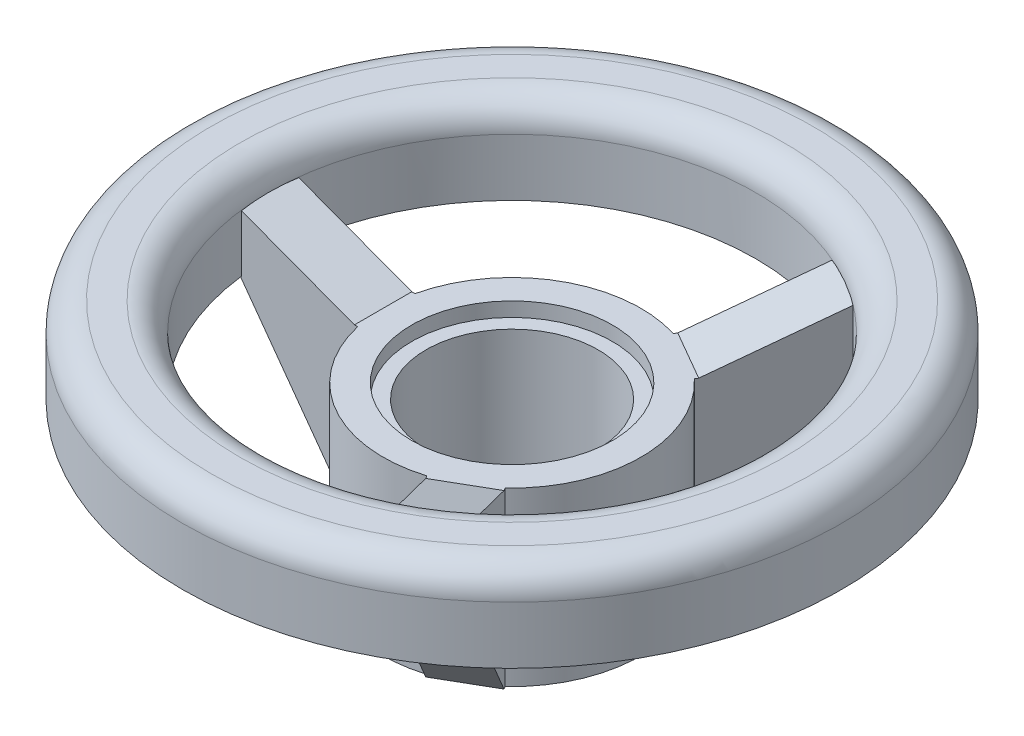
ISO-10303-21;
HEADER;
FILE_DESCRIPTION(('STEP AP214'),'2;1');
FILE_NAME('part.step','',(''),(''),'','','');
FILE_SCHEMA(('AUTOMOTIVE_DESIGN { 1 0 10303 214 1 1 1 1 }'));
ENDSEC;
DATA;
#1=APPLICATION_CONTEXT('core data for automotive mechanical design processes');
#2=APPLICATION_PROTOCOL_DEFINITION('international standard','automotive_design',2000,#1);
#3=PRODUCT_CONTEXT('',#1,'mechanical');
#4=PRODUCT('Part','Part','',(#3));
#5=PRODUCT_RELATED_PRODUCT_CATEGORY('part','',(#4));
#6=PRODUCT_DEFINITION_FORMATION('','',#4);
#7=PRODUCT_DEFINITION_CONTEXT('part definition',#1,'design');
#8=PRODUCT_DEFINITION('design','',#6,#7);
#9=PRODUCT_DEFINITION_SHAPE('','',#8);
#10=(LENGTH_UNIT() NAMED_UNIT(*) SI_UNIT(.MILLI.,.METRE.));
#11=(NAMED_UNIT(*) PLANE_ANGLE_UNIT() SI_UNIT($,.RADIAN.));
#12=(NAMED_UNIT(*) SI_UNIT($,.STERADIAN.) SOLID_ANGLE_UNIT());
#13=UNCERTAINTY_MEASURE_WITH_UNIT(LENGTH_MEASURE(1.E-05),#10,'distance_accuracy_value','');
#14=(GEOMETRIC_REPRESENTATION_CONTEXT(3) GLOBAL_UNCERTAINTY_ASSIGNED_CONTEXT((#13)) GLOBAL_UNIT_ASSIGNED_CONTEXT((#10,
#11,#12)) REPRESENTATION_CONTEXT('',''));
#15=CARTESIAN_POINT('',(0.,0.,0.));
#16=DIRECTION('',(0.,0.,1.));
#17=DIRECTION('',(1.,0.,0.));
#18=AXIS2_PLACEMENT_3D('',#15,#16,#17);
#19=CARTESIAN_POINT('',(0.,21.7519463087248,0.));
#20=DIRECTION('',(0.,1.,0.));
#21=DIRECTION('',(0.,0.,1.));
#22=AXIS2_PLACEMENT_3D('',#19,#20,#21);
#23=CYLINDRICAL_SURFACE('',#22,4.25);
#24=CARTESIAN_POINT('',(0.,-0.843750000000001,0.));
#25=DIRECTION('',(0.175561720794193,-0.936329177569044,0.304081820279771));
#26=DIRECTION('',(0.468164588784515,0.351123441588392,0.810884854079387));
#27=AXIS2_PLACEMENT_3D('',#24,#25,#26);
#28=ELLIPSE('',#27,4.53900198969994,4.25);
#29=CARTESIAN_POINT('',(2.54325557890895,0.738932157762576,3.40504787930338));
#30=VERTEX_POINT('',#29);
#31=CARTESIAN_POINT('',(2.12499999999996,0.75,3.68060796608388));
#32=VERTEX_POINT('',#31);
#33=EDGE_CURVE('E209',#30,#32,#28,.T.);
#34=ORIENTED_EDGE('',*,*,#33,.T.);
#35=CARTESIAN_POINT('',(0.,0.750000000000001,0.));
#36=DIRECTION('',(0.,1.,0.));
#37=DIRECTION('',(0.,0.,1.));
#38=AXIS2_PLACEMENT_3D('',#35,#36,#37);
#39=CIRCLE('',#38,4.25);
#40=CARTESIAN_POINT('',(2.12500000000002,0.75,-3.68060796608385));
#41=VERTEX_POINT('',#40);
#42=EDGE_CURVE('E11',#32,#41,#39,.T.);
#43=ORIENTED_EDGE('',*,*,#42,.T.);
#44=CARTESIAN_POINT('',(0.,-0.843750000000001,0.));
#45=DIRECTION('',(0.175561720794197,-0.936329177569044,-0.304081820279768));
#46=DIRECTION('',(0.468164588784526,0.351123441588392,-0.810884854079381));
#47=AXIS2_PLACEMENT_3D('',#44,#45,#46);
#48=ELLIPSE('',#47,4.53900198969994,4.25);
#49=CARTESIAN_POINT('',(2.543255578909,0.738932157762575,-3.40504787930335));
#50=VERTEX_POINT('',#49);
#51=EDGE_CURVE('E252',#41,#50,#48,.T.);
#52=ORIENTED_EDGE('',*,*,#51,.T.);
#53=DIRECTION('',(0.,1.,0.));
#54=VECTOR('',#53,1.);
#55=CARTESIAN_POINT('',(2.543255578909,21.7519463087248,-3.40504787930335));
#56=LINE('',#55,#54);
#57=CARTESIAN_POINT('',(2.543255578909,-0.25,-3.40504787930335));
#58=VERTEX_POINT('',#57);
#59=EDGE_CURVE('E410',#50,#58,#56,.F.);
#60=ORIENTED_EDGE('',*,*,#59,.T.);
#61=CARTESIAN_POINT('',(0.,-0.25,0.));
#62=DIRECTION('',(0.,1.,0.));
#63=DIRECTION('',(0.,0.,1.));
#64=AXIS2_PLACEMENT_3D('',#61,#62,#63);
#65=CIRCLE('',#64,4.25);
#66=CARTESIAN_POINT('',(2.54325557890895,-0.25,3.40504787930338));
#67=VERTEX_POINT('',#66);
#68=EDGE_CURVE('E396',#67,#58,#65,.T.);
#69=ORIENTED_EDGE('',*,*,#68,.F.);
#70=DIRECTION('',(0.,1.,0.));
#71=VECTOR('',#70,1.);
#72=CARTESIAN_POINT('',(2.54325557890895,21.7519463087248,3.40504787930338));
#73=LINE('',#72,#71);
#74=EDGE_CURVE('E237',#30,#67,#73,.F.);
#75=ORIENTED_EDGE('',*,*,#74,.F.);
#76=EDGE_LOOP('',(#34,#43,#52,#60,#69,#75));
#77=FACE_BOUND('',#76,.T.);
#78=ADVANCED_FACE('F32',(#77),#23,.F.);
#79=CARTESIAN_POINT('',(1.67723017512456,0.738932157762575,-3.90504787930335));
#80=VERTEX_POINT('',#79);
#81=EDGE_CURVE('E272',#80,#41,#48,.T.);
#82=ORIENTED_EDGE('',*,*,#81,.T.);
#83=CARTESIAN_POINT('',(0.,0.750000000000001,0.));
#84=DIRECTION('',(0.,1.,0.));
#85=DIRECTION('',(0.,0.,1.));
#86=AXIS2_PLACEMENT_3D('',#83,#84,#85);
#87=CIRCLE('',#86,4.25);
#88=CARTESIAN_POINT('',(-4.25,0.75,0.));
#89=VERTEX_POINT('',#88);
#90=EDGE_CURVE('E40',#41,#89,#87,.T.);
#91=ORIENTED_EDGE('',*,*,#90,.T.);
#92=CARTESIAN_POINT('',(0.,-0.843750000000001,0.));
#93=DIRECTION('',(-0.351123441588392,-0.936329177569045,0.));
#94=DIRECTION('',(-0.936329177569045,0.351123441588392,0.));
#95=AXIS2_PLACEMENT_3D('',#92,#93,#94);
#96=ELLIPSE('',#95,4.53900198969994,4.25);
#97=CARTESIAN_POINT('',(-4.22048575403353,0.738932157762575,-0.5));
#98=VERTEX_POINT('',#97);
#99=EDGE_CURVE('E255',#89,#98,#96,.T.);
#100=ORIENTED_EDGE('',*,*,#99,.T.);
#101=DIRECTION('',(0.,1.,0.));
#102=VECTOR('',#101,1.);
#103=CARTESIAN_POINT('',(-4.22048575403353,21.7519463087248,-0.5));
#104=LINE('',#103,#102);
#105=CARTESIAN_POINT('',(-4.22048575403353,-0.25,-0.5));
#106=VERTEX_POINT('',#105);
#107=EDGE_CURVE('E330',#98,#106,#104,.F.);
#108=ORIENTED_EDGE('',*,*,#107,.T.);
#109=CARTESIAN_POINT('',(1.67723017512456,-0.25,-3.90504787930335));
#110=VERTEX_POINT('',#109);
#111=EDGE_CURVE('E269',#110,#106,#65,.T.);
#112=ORIENTED_EDGE('',*,*,#111,.F.);
#113=DIRECTION('',(0.,1.,0.));
#114=VECTOR('',#113,1.);
#115=CARTESIAN_POINT('',(1.67723017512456,21.7519463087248,-3.90504787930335));
#116=LINE('',#115,#114);
#117=EDGE_CURVE('E415',#80,#110,#116,.F.);
#118=ORIENTED_EDGE('',*,*,#117,.F.);
#119=EDGE_LOOP('',(#82,#91,#100,#108,#112,#118));
#120=FACE_BOUND('',#119,.T.);
#121=ADVANCED_FACE('F363',(#120),#23,.F.);
#122=CARTESIAN_POINT('',(0.,21.7519463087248,0.));
#123=DIRECTION('',(0.,1.,0.));
#124=DIRECTION('',(0.,0.,1.));
#125=AXIS2_PLACEMENT_3D('',#122,#123,#124);
#126=CYLINDRICAL_SURFACE('',#125,2.25);
#127=CARTESIAN_POINT('',(0.,-3.,0.));
#128=DIRECTION('',(0.,1.,0.));
#129=DIRECTION('',(0.,0.,1.));
#130=AXIS2_PLACEMENT_3D('',#127,#128,#129);
#131=CIRCLE('',#130,2.25);
#132=CARTESIAN_POINT('',(-2.19374109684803,-3.,0.5));
#133=VERTEX_POINT('',#132);
#134=CARTESIAN_POINT('',(0.663857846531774,-3.,2.14983551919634));
#135=VERTEX_POINT('',#134);
#136=EDGE_CURVE('E284',#133,#135,#131,.T.);
#137=ORIENTED_EDGE('',*,*,#136,.T.);
#138=DIRECTION('',(0.,1.,0.));
#139=VECTOR('',#138,1.);
#140=CARTESIAN_POINT('',(0.663857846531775,21.7519463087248,2.14983551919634));
#141=LINE('',#140,#139);
#142=CARTESIAN_POINT('',(0.663857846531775,0.,2.14983551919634));
#143=VERTEX_POINT('',#142);
#144=EDGE_CURVE('E232',#135,#143,#141,.T.);
#145=ORIENTED_EDGE('',*,*,#144,.T.);
#146=CARTESIAN_POINT('',(0.,0.,0.));
#147=DIRECTION('',(0.,1.,0.));
#148=DIRECTION('',(0.,0.,1.));
#149=AXIS2_PLACEMENT_3D('',#146,#147,#148);
#150=CIRCLE('',#149,2.25);
#151=CARTESIAN_POINT('',(-2.19374109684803,0.,0.5));
#152=VERTEX_POINT('',#151);
#153=EDGE_CURVE('E279',#152,#143,#150,.T.);
#154=ORIENTED_EDGE('',*,*,#153,.F.);
#155=DIRECTION('',(0.,1.,0.));
#156=VECTOR('',#155,1.);
#157=CARTESIAN_POINT('',(-2.19374109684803,21.7519463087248,0.5));
#158=LINE('',#157,#156);
#159=EDGE_CURVE('E300',#152,#133,#158,.F.);
#160=ORIENTED_EDGE('',*,*,#159,.T.);
#161=EDGE_LOOP('',(#137,#145,#154,#160));
#162=FACE_BOUND('',#161,.T.);
#163=ADVANCED_FACE('F464',(#162),#126,.T.);
#164=DIRECTION('',(0.,1.,0.));
#165=VECTOR('',#164,1.);
#166=CARTESIAN_POINT('',(1.52988325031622,21.7519463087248,1.64983551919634));
#167=LINE('',#166,#165);
#168=CARTESIAN_POINT('',(1.52988325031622,-3.,1.64983551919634));
#169=VERTEX_POINT('',#168);
#170=CARTESIAN_POINT('',(1.52988325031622,0.,1.64983551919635));
#171=VERTEX_POINT('',#170);
#172=EDGE_CURVE('E191',#169,#171,#167,.T.);
#173=ORIENTED_EDGE('',*,*,#172,.F.);
#174=CARTESIAN_POINT('',(1.52988325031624,-3.,-1.64983551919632));
#175=VERTEX_POINT('',#174);
#176=EDGE_CURVE('E288',#169,#175,#131,.T.);
#177=ORIENTED_EDGE('',*,*,#176,.T.);
#178=DIRECTION('',(0.,1.,0.));
#179=VECTOR('',#178,1.);
#180=CARTESIAN_POINT('',(1.52988325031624,21.7519463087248,-1.64983551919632));
#181=LINE('',#180,#179);
#182=CARTESIAN_POINT('',(1.52988325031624,0.,-1.64983551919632));
#183=VERTEX_POINT('',#182);
#184=EDGE_CURVE('E382',#175,#183,#181,.T.);
#185=ORIENTED_EDGE('',*,*,#184,.T.);
#186=EDGE_CURVE('E283',#171,#183,#150,.T.);
#187=ORIENTED_EDGE('',*,*,#186,.F.);
#188=EDGE_LOOP('',(#173,#177,#185,#187));
#189=FACE_BOUND('',#188,.T.);
#190=ADVANCED_FACE('F461',(#189),#126,.T.);
#191=CARTESIAN_POINT('',(0.,21.7519463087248,0.));
#192=DIRECTION('',(0.,1.,0.));
#193=DIRECTION('',(0.,0.,1.));
#194=AXIS2_PLACEMENT_3D('',#191,#192,#193);
#195=CYLINDRICAL_SURFACE('',#194,5.75);
#196=CARTESIAN_POINT('',(0.,0.750000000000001,0.));
#197=DIRECTION('',(0.,1.,0.));
#198=DIRECTION('',(0.,0.,1.));
#199=AXIS2_PLACEMENT_3D('',#196,#197,#198);
#200=CIRCLE('',#199,5.75);
#201=CARTESIAN_POINT('',(0.,0.750000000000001,5.75));
#202=VERTEX_POINT('',#201);
#203=EDGE_CURVE('E371',#202,#202,#200,.F.);
#204=ORIENTED_EDGE('',*,*,#203,.T.);
#205=EDGE_LOOP('',(#204));
#206=FACE_BOUND('',#205,.T.);
#207=CARTESIAN_POINT('',(0.,-0.25,0.));
#208=DIRECTION('',(0.,1.,0.));
#209=DIRECTION('',(0.,0.,1.));
#210=AXIS2_PLACEMENT_3D('',#207,#208,#209);
#211=CIRCLE('',#210,5.75);
#212=CARTESIAN_POINT('',(0.,-0.25,5.75));
#213=VERTEX_POINT('',#212);
#214=EDGE_CURVE('E391',#213,#213,#211,.T.);
#215=ORIENTED_EDGE('',*,*,#214,.T.);
#216=EDGE_LOOP('',(#215));
#217=FACE_BOUND('',#216,.T.);
#218=ADVANCED_FACE('F463',(#206,#217),#195,.T.);
#219=CARTESIAN_POINT('',(-5.75,-0.25,0.));
#220=DIRECTION('',(0.,-1.,0.));
#221=DIRECTION('',(0.,0.,-1.));
#222=AXIS2_PLACEMENT_3D('',#219,#220,#221);
#223=PLANE('',#222);
#224=DIRECTION('',(0.499999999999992,0.,0.866025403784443));
#225=VECTOR('',#224,1.);
#226=CARTESIAN_POINT('',(-1.00448729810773,-0.25,-2.73982303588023));
#227=LINE('',#226,#225);
#228=CARTESIAN_POINT('',(2.55801270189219,-0.25,3.43060796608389));
#229=VERTEX_POINT('',#228);
#230=EDGE_CURVE('E235',#67,#229,#227,.T.);
#231=ORIENTED_EDGE('',*,*,#230,.F.);
#232=ORIENTED_EDGE('',*,*,#68,.T.);
#233=DIRECTION('',(0.500000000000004,0.,-0.866025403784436));
#234=VECTOR('',#233,1.);
#235=CARTESIAN_POINT('',(-1.0044872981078,-0.25,2.73982303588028));
#236=LINE('',#235,#234);
#237=CARTESIAN_POINT('',(2.55801270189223,-0.25,-3.43060796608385));
#238=VERTEX_POINT('',#237);
#239=EDGE_CURVE('E401',#58,#238,#236,.T.);
#240=ORIENTED_EDGE('',*,*,#239,.T.);
#241=DIRECTION('',(0.866025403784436,0.,0.500000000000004));
#242=VECTOR('',#241,1.);
#243=CARTESIAN_POINT('',(1.6919872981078,-0.25,-3.93060796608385));
#244=LINE('',#243,#242);
#245=CARTESIAN_POINT('',(1.6919872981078,-0.25,-3.93060796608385));
#246=VERTEX_POINT('',#245);
#247=EDGE_CURVE('E420',#246,#238,#244,.T.);
#248=ORIENTED_EDGE('',*,*,#247,.F.);
#249=DIRECTION('',(0.500000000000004,0.,-0.866025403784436));
#250=VECTOR('',#249,1.);
#251=CARTESIAN_POINT('',(-1.87051270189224,-0.25,2.23982303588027));
#252=LINE('',#251,#250);
#253=EDGE_CURVE('E277',#110,#246,#252,.T.);
#254=ORIENTED_EDGE('',*,*,#253,.F.);
#255=ORIENTED_EDGE('',*,*,#111,.T.);
#256=DIRECTION('',(-1.,0.,0.));
#257=VECTOR('',#256,1.);
#258=CARTESIAN_POINT('',(-5.75,-0.25,-0.5));
#259=LINE('',#258,#257);
#260=CARTESIAN_POINT('',(-4.25,-0.25,-0.5));
#261=VERTEX_POINT('',#260);
#262=EDGE_CURVE('E333',#106,#261,#259,.T.);
#263=ORIENTED_EDGE('',*,*,#262,.T.);
#264=DIRECTION('',(0.,0.,-1.));
#265=VECTOR('',#264,1.);
#266=CARTESIAN_POINT('',(-4.25,-0.25,0.5));
#267=LINE('',#266,#265);
#268=CARTESIAN_POINT('',(-4.25,-0.25,0.5));
#269=VERTEX_POINT('',#268);
#270=EDGE_CURVE('E326',#269,#261,#267,.T.);
#271=ORIENTED_EDGE('',*,*,#270,.F.);
#272=DIRECTION('',(-1.,0.,0.));
#273=VECTOR('',#272,1.);
#274=CARTESIAN_POINT('',(-5.75,-0.25,0.5));
#275=LINE('',#274,#273);
#276=CARTESIAN_POINT('',(-4.22048575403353,-0.25,0.5));
#277=VERTEX_POINT('',#276);
#278=EDGE_CURVE('E259',#277,#269,#275,.T.);
#279=ORIENTED_EDGE('',*,*,#278,.F.);
#280=CARTESIAN_POINT('',(1.67723017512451,-0.25,3.90504787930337));
#281=VERTEX_POINT('',#280);
#282=EDGE_CURVE('E264',#277,#281,#65,.T.);
#283=ORIENTED_EDGE('',*,*,#282,.T.);
#284=DIRECTION('',(0.499999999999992,0.,0.866025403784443));
#285=VECTOR('',#284,1.);
#286=CARTESIAN_POINT('',(-1.87051270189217,-0.25,-2.23982303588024));
#287=LINE('',#286,#285);
#288=CARTESIAN_POINT('',(1.69198729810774,-0.250000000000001,3.93060796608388));
#289=VERTEX_POINT('',#288);
#290=EDGE_CURVE('E204',#281,#289,#287,.T.);
#291=ORIENTED_EDGE('',*,*,#290,.T.);
#292=DIRECTION('',(-0.866025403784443,0.,0.499999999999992));
#293=VECTOR('',#292,1.);
#294=CARTESIAN_POINT('',(2.55801270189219,-0.25,3.43060796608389));
#295=LINE('',#294,#293);
#296=EDGE_CURVE('E205',#229,#289,#295,.T.);
#297=ORIENTED_EDGE('',*,*,#296,.F.);
#298=EDGE_LOOP('',(#231,#232,#240,#248,#254,#255,#263,#271,#279,#283,#291,#297));
#299=FACE_BOUND('',#298,.T.);
#300=ORIENTED_EDGE('',*,*,#214,.F.);
#301=EDGE_LOOP('',(#300));
#302=FACE_BOUND('',#301,.T.);
#303=ADVANCED_FACE('F352',(#299,#302),#223,.T.);
#304=CARTESIAN_POINT('',(-4.22048575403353,0.738932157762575,0.5));
#305=VERTEX_POINT('',#304);
#306=EDGE_CURVE('E258',#305,#89,#96,.T.);
#307=ORIENTED_EDGE('',*,*,#306,.T.);
#308=CARTESIAN_POINT('',(0.,0.750000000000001,0.));
#309=DIRECTION('',(0.,1.,0.));
#310=DIRECTION('',(0.,0.,1.));
#311=AXIS2_PLACEMENT_3D('',#308,#309,#310);
#312=CIRCLE('',#311,4.25);
#313=EDGE_CURVE('E54',#89,#32,#312,.T.);
#314=ORIENTED_EDGE('',*,*,#313,.T.);
#315=CARTESIAN_POINT('',(1.67723017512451,0.738932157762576,3.90504787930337));
#316=VERTEX_POINT('',#315);
#317=EDGE_CURVE('E240',#32,#316,#28,.T.);
#318=ORIENTED_EDGE('',*,*,#317,.T.);
#319=DIRECTION('',(0.,1.,0.));
#320=VECTOR('',#319,1.);
#321=CARTESIAN_POINT('',(1.67723017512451,21.7519463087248,3.90504787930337));
#322=LINE('',#321,#320);
#323=EDGE_CURVE('E229',#316,#281,#322,.F.);
#324=ORIENTED_EDGE('',*,*,#323,.T.);
#325=ORIENTED_EDGE('',*,*,#282,.F.);
#326=DIRECTION('',(0.,1.,0.));
#327=VECTOR('',#326,1.);
#328=CARTESIAN_POINT('',(-4.22048575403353,21.7519463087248,0.5));
#329=LINE('',#328,#327);
#330=EDGE_CURVE('E335',#305,#277,#329,.F.);
#331=ORIENTED_EDGE('',*,*,#330,.F.);
#332=EDGE_LOOP('',(#307,#314,#318,#324,#325,#331));
#333=FACE_BOUND('',#332,.T.);
#334=ADVANCED_FACE('F368',(#333),#23,.F.);
#335=CARTESIAN_POINT('',(-1.75,0.,0.5));
#336=DIRECTION('',(0.,-1.,0.));
#337=DIRECTION('',(0.,0.,-1.));
#338=AXIS2_PLACEMENT_3D('',#335,#336,#337);
#339=PLANE('',#338);
#340=CARTESIAN_POINT('',(0.,0.,0.));
#341=DIRECTION('',(0.,1.,0.));
#342=DIRECTION('',(0.,0.,1.));
#343=AXIS2_PLACEMENT_3D('',#340,#341,#342);
#344=CIRCLE('',#343,1.75);
#345=CARTESIAN_POINT('',(0.,0.,1.75));
#346=VERTEX_POINT('',#345);
#347=EDGE_CURVE('E297',#346,#346,#344,.T.);
#348=ORIENTED_EDGE('',*,*,#347,.F.);
#349=EDGE_LOOP('',(#348));
#350=FACE_BOUND('',#349,.T.);
#351=ORIENTED_EDGE('',*,*,#153,.T.);
#352=DIRECTION('',(0.499999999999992,0.,0.866025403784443));
#353=VECTOR('',#352,1.);
#354=CARTESIAN_POINT('',(0.441987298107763,0.,1.76554445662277));
#355=LINE('',#354,#353);
#356=CARTESIAN_POINT('',(0.691987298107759,0.,2.19855715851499));
#357=VERTEX_POINT('',#356);
#358=EDGE_CURVE('E200',#143,#357,#355,.T.);
#359=ORIENTED_EDGE('',*,*,#358,.T.);
#360=DIRECTION('',(-0.866025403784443,0.,0.499999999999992));
#361=VECTOR('',#360,1.);
#362=CARTESIAN_POINT('',(1.5580127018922,0.,1.698557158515));
#363=LINE('',#362,#361);
#364=CARTESIAN_POINT('',(1.5580127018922,0.,1.698557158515));
#365=VERTEX_POINT('',#364);
#366=EDGE_CURVE('E197',#365,#357,#363,.T.);
#367=ORIENTED_EDGE('',*,*,#366,.F.);
#368=DIRECTION('',(0.499999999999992,0.,0.866025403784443));
#369=VECTOR('',#368,1.);
#370=CARTESIAN_POINT('',(1.30801270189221,0.,1.26554445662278));
#371=LINE('',#370,#369);
#372=EDGE_CURVE('E184',#171,#365,#371,.T.);
#373=ORIENTED_EDGE('',*,*,#372,.F.);
#374=ORIENTED_EDGE('',*,*,#186,.T.);
#375=DIRECTION('',(0.500000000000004,0.,-0.866025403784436));
#376=VECTOR('',#375,1.);
#377=CARTESIAN_POINT('',(1.30801270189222,0.,-1.26554445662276));
#378=LINE('',#377,#376);
#379=CARTESIAN_POINT('',(1.55801270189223,0.,-1.69855715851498));
#380=VERTEX_POINT('',#379);
#381=EDGE_CURVE('E443',#183,#380,#378,.T.);
#382=ORIENTED_EDGE('',*,*,#381,.T.);
#383=DIRECTION('',(0.866025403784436,0.,0.500000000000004));
#384=VECTOR('',#383,1.);
#385=CARTESIAN_POINT('',(0.69198729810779,0.,-2.19855715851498));
#386=LINE('',#385,#384);
#387=CARTESIAN_POINT('',(0.69198729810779,0.,-2.19855715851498));
#388=VERTEX_POINT('',#387);
#389=EDGE_CURVE('E418',#388,#380,#386,.T.);
#390=ORIENTED_EDGE('',*,*,#389,.F.);
#391=DIRECTION('',(0.500000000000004,0.,-0.866025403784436));
#392=VECTOR('',#391,1.);
#393=CARTESIAN_POINT('',(0.441987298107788,0.,-1.76554445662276));
#394=LINE('',#393,#392);
#395=CARTESIAN_POINT('',(0.663857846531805,0.,-2.14983551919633));
#396=VERTEX_POINT('',#395);
#397=EDGE_CURVE('E243',#396,#388,#394,.T.);
#398=ORIENTED_EDGE('',*,*,#397,.F.);
#399=CARTESIAN_POINT('',(-2.19374109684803,0.,-0.5));
#400=VERTEX_POINT('',#399);
#401=EDGE_CURVE('E273',#396,#400,#150,.T.);
#402=ORIENTED_EDGE('',*,*,#401,.T.);
#403=DIRECTION('',(-1.,0.,0.));
#404=VECTOR('',#403,1.);
#405=CARTESIAN_POINT('',(-1.75,0.,-0.5));
#406=LINE('',#405,#404);
#407=CARTESIAN_POINT('',(-2.25,0.,-0.5));
#408=VERTEX_POINT('',#407);
#409=EDGE_CURVE('E302',#400,#408,#406,.T.);
#410=ORIENTED_EDGE('',*,*,#409,.T.);
#411=DIRECTION('',(0.,0.,-1.));
#412=VECTOR('',#411,1.);
#413=CARTESIAN_POINT('',(-2.25,0.,0.5));
#414=LINE('',#413,#412);
#415=CARTESIAN_POINT('',(-2.25,0.,0.5));
#416=VERTEX_POINT('',#415);
#417=EDGE_CURVE('E328',#416,#408,#414,.T.);
#418=ORIENTED_EDGE('',*,*,#417,.F.);
#419=DIRECTION('',(-1.,0.,0.));
#420=VECTOR('',#419,1.);
#421=CARTESIAN_POINT('',(-1.75,0.,0.5));
#422=LINE('',#421,#420);
#423=EDGE_CURVE('E303',#152,#416,#422,.T.);
#424=ORIENTED_EDGE('',*,*,#423,.F.);
#425=EDGE_LOOP('',(#351,#359,#367,#373,#374,#382,#390,#398,#402,#410,#418,#424));
#426=FACE_BOUND('',#425,.T.);
#427=ADVANCED_FACE('F199',(#350,#426),#339,.F.);
#428=CARTESIAN_POINT('',(-2.25,0.,0.5));
#429=DIRECTION('',(-0.351123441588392,-0.936329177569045,0.));
#430=DIRECTION('',(0.936329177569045,-0.351123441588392,0.));
#431=AXIS2_PLACEMENT_3D('',#428,#429,#430);
#432=PLANE('',#431);
#433=ORIENTED_EDGE('',*,*,#306,.F.);
#434=DIRECTION('',(-0.936329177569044,0.351123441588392,0.));
#435=VECTOR('',#434,1.);
#436=CARTESIAN_POINT('',(-2.25,0.,0.5));
#437=LINE('',#436,#435);
#438=EDGE_CURVE('E305',#416,#305,#437,.T.);
#439=ORIENTED_EDGE('',*,*,#438,.F.);
#440=ORIENTED_EDGE('',*,*,#417,.T.);
#441=DIRECTION('',(-0.936329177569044,0.351123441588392,0.));
#442=VECTOR('',#441,1.);
#443=CARTESIAN_POINT('',(-2.25,0.,-0.5));
#444=LINE('',#443,#442);
#445=EDGE_CURVE('E317',#408,#98,#444,.T.);
#446=ORIENTED_EDGE('',*,*,#445,.T.);
#447=ORIENTED_EDGE('',*,*,#99,.F.);
#448=EDGE_LOOP('',(#433,#439,#440,#446,#447));
#449=FACE_BOUND('',#448,.T.);
#450=ADVANCED_FACE('F366',(#449),#432,.F.);
#451=CARTESIAN_POINT('',(-4.25,-0.25,0.5));
#452=DIRECTION('',(0.808736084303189,0.588171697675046,0.));
#453=DIRECTION('',(-0.588171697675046,0.808736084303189,0.));
#454=AXIS2_PLACEMENT_3D('',#451,#452,#453);
#455=PLANE('',#454);
#456=DIRECTION('',(0.588171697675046,-0.808736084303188,0.));
#457=VECTOR('',#456,1.);
#458=CARTESIAN_POINT('',(-4.25,-0.25,-0.5));
#459=LINE('',#458,#457);
#460=CARTESIAN_POINT('',(-2.25,-3.,-0.5));
#461=VERTEX_POINT('',#460);
#462=EDGE_CURVE('E320',#261,#461,#459,.T.);
#463=ORIENTED_EDGE('',*,*,#462,.T.);
#464=DIRECTION('',(0.,0.,-1.));
#465=VECTOR('',#464,1.);
#466=CARTESIAN_POINT('',(-2.25,-3.,0.5));
#467=LINE('',#466,#465);
#468=CARTESIAN_POINT('',(-2.25,-3.,0.5));
#469=VERTEX_POINT('',#468);
#470=EDGE_CURVE('E314',#469,#461,#467,.T.);
#471=ORIENTED_EDGE('',*,*,#470,.F.);
#472=DIRECTION('',(0.588171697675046,-0.808736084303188,0.));
#473=VECTOR('',#472,1.);
#474=CARTESIAN_POINT('',(-4.25,-0.25,0.5));
#475=LINE('',#474,#473);
#476=EDGE_CURVE('E309',#269,#469,#475,.T.);
#477=ORIENTED_EDGE('',*,*,#476,.F.);
#478=ORIENTED_EDGE('',*,*,#270,.T.);
#479=EDGE_LOOP('',(#463,#471,#477,#478));
#480=FACE_BOUND('',#479,.T.);
#481=ADVANCED_FACE('F348',(#480),#455,.F.);
#482=CARTESIAN_POINT('',(-2.25,-3.,0.5));
#483=DIRECTION('',(0.,1.,0.));
#484=DIRECTION('',(-1.,0.,0.));
#485=AXIS2_PLACEMENT_3D('',#482,#483,#484);
#486=PLANE('',#485);
#487=ORIENTED_EDGE('',*,*,#176,.F.);
#488=DIRECTION('',(-0.499999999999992,0.,-0.866025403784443));
#489=VECTOR('',#488,1.);
#490=CARTESIAN_POINT('',(1.5580127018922,-3.,1.698557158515));
#491=LINE('',#490,#489);
#492=CARTESIAN_POINT('',(1.5580127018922,-3.,1.698557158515));
#493=VERTEX_POINT('',#492);
#494=EDGE_CURVE('E212',#493,#169,#491,.T.);
#495=ORIENTED_EDGE('',*,*,#494,.F.);
#496=DIRECTION('',(-0.866025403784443,0.,0.499999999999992));
#497=VECTOR('',#496,1.);
#498=CARTESIAN_POINT('',(1.5580127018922,-3.,1.698557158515));
#499=LINE('',#498,#497);
#500=CARTESIAN_POINT('',(0.691987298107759,-3.,2.19855715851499));
#501=VERTEX_POINT('',#500);
#502=EDGE_CURVE('E216',#493,#501,#499,.T.);
#503=ORIENTED_EDGE('',*,*,#502,.T.);
#504=DIRECTION('',(-0.499999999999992,0.,-0.866025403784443));
#505=VECTOR('',#504,1.);
#506=CARTESIAN_POINT('',(0.691987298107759,-3.,2.19855715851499));
#507=LINE('',#506,#505);
#508=EDGE_CURVE('E194',#501,#135,#507,.T.);
#509=ORIENTED_EDGE('',*,*,#508,.T.);
#510=ORIENTED_EDGE('',*,*,#136,.F.);
#511=DIRECTION('',(1.,0.,0.));
#512=VECTOR('',#511,1.);
#513=CARTESIAN_POINT('',(-2.25,-3.,0.5));
#514=LINE('',#513,#512);
#515=EDGE_CURVE('E311',#469,#133,#514,.T.);
#516=ORIENTED_EDGE('',*,*,#515,.F.);
#517=ORIENTED_EDGE('',*,*,#470,.T.);
#518=DIRECTION('',(1.,0.,0.));
#519=VECTOR('',#518,1.);
#520=CARTESIAN_POINT('',(-2.25,-3.,-0.5));
#521=LINE('',#520,#519);
#522=CARTESIAN_POINT('',(-2.19374109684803,-3.,-0.5));
#523=VERTEX_POINT('',#522);
#524=EDGE_CURVE('E306',#461,#523,#521,.T.);
#525=ORIENTED_EDGE('',*,*,#524,.T.);
#526=CARTESIAN_POINT('',(0.663857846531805,-3.,-2.14983551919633));
#527=VERTEX_POINT('',#526);
#528=EDGE_CURVE('E282',#527,#523,#131,.T.);
#529=ORIENTED_EDGE('',*,*,#528,.F.);
#530=DIRECTION('',(-0.500000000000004,0.,0.866025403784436));
#531=VECTOR('',#530,1.);
#532=CARTESIAN_POINT('',(0.69198729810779,-3.,-2.19855715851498));
#533=LINE('',#532,#531);
#534=CARTESIAN_POINT('',(0.69198729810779,-3.,-2.19855715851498));
#535=VERTEX_POINT('',#534);
#536=EDGE_CURVE('E432',#535,#527,#533,.T.);
#537=ORIENTED_EDGE('',*,*,#536,.F.);
#538=DIRECTION('',(0.866025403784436,0.,0.500000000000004));
#539=VECTOR('',#538,1.);
#540=CARTESIAN_POINT('',(0.69198729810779,-3.,-2.19855715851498));
#541=LINE('',#540,#539);
#542=CARTESIAN_POINT('',(1.55801270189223,-3.,-1.69855715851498));
#543=VERTEX_POINT('',#542);
#544=EDGE_CURVE('E430',#535,#543,#541,.T.);
#545=ORIENTED_EDGE('',*,*,#544,.T.);
#546=DIRECTION('',(-0.500000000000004,0.,0.866025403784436));
#547=VECTOR('',#546,1.);
#548=CARTESIAN_POINT('',(1.55801270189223,-3.,-1.69855715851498));
#549=LINE('',#548,#547);
#550=EDGE_CURVE('E437',#543,#175,#549,.T.);
#551=ORIENTED_EDGE('',*,*,#550,.T.);
#552=EDGE_LOOP('',(#487,#495,#503,#509,#510,#516,#517,#525,#529,#537,#545,#551));
#553=FACE_BOUND('',#552,.T.);
#554=CARTESIAN_POINT('',(0.,-3.,0.));
#555=DIRECTION('',(0.,1.,0.));
#556=DIRECTION('',(0.,0.,1.));
#557=AXIS2_PLACEMENT_3D('',#554,#555,#556);
#558=CIRCLE('',#557,1.5);
#559=CARTESIAN_POINT('',(0.,-3.,1.5));
#560=VERTEX_POINT('',#559);
#561=EDGE_CURVE('E287',#560,#560,#558,.T.);
#562=ORIENTED_EDGE('',*,*,#561,.T.);
#563=EDGE_LOOP('',(#562));
#564=FACE_BOUND('',#563,.T.);
#565=ADVANCED_FACE('F454',(#553,#564),#486,.F.);
#566=CARTESIAN_POINT('',(-1.75,0.,0.5));
#567=DIRECTION('',(0.,0.,1.));
#568=DIRECTION('',(1.,0.,0.));
#569=AXIS2_PLACEMENT_3D('',#566,#567,#568);
#570=PLANE('',#569);
#571=ORIENTED_EDGE('',*,*,#159,.F.);
#572=ORIENTED_EDGE('',*,*,#423,.T.);
#573=ORIENTED_EDGE('',*,*,#438,.T.);
#574=ORIENTED_EDGE('',*,*,#330,.T.);
#575=ORIENTED_EDGE('',*,*,#278,.T.);
#576=ORIENTED_EDGE('',*,*,#476,.T.);
#577=ORIENTED_EDGE('',*,*,#515,.T.);
#578=EDGE_LOOP('',(#571,#572,#573,#574,#575,#576,#577));
#579=FACE_BOUND('',#578,.T.);
#580=ADVANCED_FACE('F341',(#579),#570,.T.);
#581=CARTESIAN_POINT('',(-1.75,0.,-0.5));
#582=DIRECTION('',(0.,0.,1.));
#583=DIRECTION('',(1.,0.,0.));
#584=AXIS2_PLACEMENT_3D('',#581,#582,#583);
#585=PLANE('',#584);
#586=ORIENTED_EDGE('',*,*,#409,.F.);
#587=DIRECTION('',(0.,1.,0.));
#588=VECTOR('',#587,1.);
#589=CARTESIAN_POINT('',(-2.19374109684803,21.7519463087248,-0.5));
#590=LINE('',#589,#588);
#591=EDGE_CURVE('E387',#400,#523,#590,.F.);
#592=ORIENTED_EDGE('',*,*,#591,.T.);
#593=ORIENTED_EDGE('',*,*,#524,.F.);
#594=ORIENTED_EDGE('',*,*,#462,.F.);
#595=ORIENTED_EDGE('',*,*,#262,.F.);
#596=ORIENTED_EDGE('',*,*,#107,.F.);
#597=ORIENTED_EDGE('',*,*,#445,.F.);
#598=EDGE_LOOP('',(#586,#592,#593,#594,#595,#596,#597));
#599=FACE_BOUND('',#598,.T.);
#600=ADVANCED_FACE('F360',(#599),#585,.F.);
#601=CARTESIAN_POINT('',(0.,21.7519463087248,0.));
#602=DIRECTION('',(0.,1.,0.));
#603=DIRECTION('',(0.,0.,1.));
#604=AXIS2_PLACEMENT_3D('',#601,#602,#603);
#605=CYLINDRICAL_SURFACE('',#604,1.75);
#606=ORIENTED_EDGE('',*,*,#347,.T.);
#607=EDGE_LOOP('',(#606));
#608=FACE_BOUND('',#607,.T.);
#609=CARTESIAN_POINT('',(0.,-0.25,0.));
#610=DIRECTION('',(0.,1.,0.));
#611=DIRECTION('',(0.,0.,1.));
#612=AXIS2_PLACEMENT_3D('',#609,#610,#611);
#613=CIRCLE('',#612,1.75);
#614=CARTESIAN_POINT('',(0.,-0.25,1.75));
#615=VERTEX_POINT('',#614);
#616=EDGE_CURVE('E294',#615,#615,#613,.T.);
#617=ORIENTED_EDGE('',*,*,#616,.F.);
#618=EDGE_LOOP('',(#617));
#619=FACE_BOUND('',#618,.T.);
#620=ADVANCED_FACE('F622',(#608,#619),#605,.F.);
#621=CARTESIAN_POINT('',(-1.75,-0.249999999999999,0.));
#622=DIRECTION('',(0.,1.,0.));
#623=DIRECTION('',(0.,0.,1.));
#624=AXIS2_PLACEMENT_3D('',#621,#622,#623);
#625=PLANE('',#624);
#626=ORIENTED_EDGE('',*,*,#616,.T.);
#627=EDGE_LOOP('',(#626));
#628=FACE_BOUND('',#627,.T.);
#629=CARTESIAN_POINT('',(0.,-0.25,0.));
#630=DIRECTION('',(0.,1.,0.));
#631=DIRECTION('',(0.,0.,1.));
#632=AXIS2_PLACEMENT_3D('',#629,#630,#631);
#633=CIRCLE('',#632,1.5);
#634=CARTESIAN_POINT('',(0.,-0.25,1.5));
#635=VERTEX_POINT('',#634);
#636=EDGE_CURVE('E291',#635,#635,#633,.T.);
#637=ORIENTED_EDGE('',*,*,#636,.F.);
#638=EDGE_LOOP('',(#637));
#639=FACE_BOUND('',#638,.T.);
#640=ADVANCED_FACE('F629',(#628,#639),#625,.T.);
#641=CARTESIAN_POINT('',(0.,21.7519463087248,0.));
#642=DIRECTION('',(0.,1.,0.));
#643=DIRECTION('',(0.,0.,1.));
#644=AXIS2_PLACEMENT_3D('',#641,#642,#643);
#645=CYLINDRICAL_SURFACE('',#644,1.5);
#646=ORIENTED_EDGE('',*,*,#636,.T.);
#647=EDGE_LOOP('',(#646));
#648=FACE_BOUND('',#647,.T.);
#649=ORIENTED_EDGE('',*,*,#561,.F.);
#650=EDGE_LOOP('',(#649));
#651=FACE_BOUND('',#650,.T.);
#652=ADVANCED_FACE('F475',(#648,#651),#645,.F.);
#653=DIRECTION('',(0.,1.,0.));
#654=VECTOR('',#653,1.);
#655=CARTESIAN_POINT('',(0.663857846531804,21.7519463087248,-2.14983551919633));
#656=LINE('',#655,#654);
#657=EDGE_CURVE('E270',#527,#396,#656,.T.);
#658=ORIENTED_EDGE('',*,*,#657,.F.);
#659=ORIENTED_EDGE('',*,*,#528,.T.);
#660=ORIENTED_EDGE('',*,*,#591,.F.);
#661=ORIENTED_EDGE('',*,*,#401,.F.);
#662=EDGE_LOOP('',(#658,#659,#660,#661));
#663=FACE_BOUND('',#662,.T.);
#664=ADVANCED_FACE('F459',(#663),#126,.T.);
#665=CARTESIAN_POINT('',(0.69198729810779,0.,-2.19855715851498));
#666=DIRECTION('',(0.175561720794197,-0.936329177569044,-0.304081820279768));
#667=DIRECTION('',(0.,0.308879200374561,-0.951101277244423));
#668=AXIS2_PLACEMENT_3D('',#665,#666,#667);
#669=PLANE('',#668);
#670=ORIENTED_EDGE('',*,*,#81,.F.);
#671=DIRECTION('',(0.468164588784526,0.351123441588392,-0.810884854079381));
#672=VECTOR('',#671,1.);
#673=CARTESIAN_POINT('',(0.69198729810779,0.,-2.19855715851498));
#674=LINE('',#673,#672);
#675=EDGE_CURVE('E433',#388,#80,#674,.T.);
#676=ORIENTED_EDGE('',*,*,#675,.F.);
#677=ORIENTED_EDGE('',*,*,#389,.T.);
#678=DIRECTION('',(0.468164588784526,0.351123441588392,-0.810884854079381));
#679=VECTOR('',#678,1.);
#680=CARTESIAN_POINT('',(1.55801270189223,0.,-1.69855715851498));
#681=LINE('',#680,#679);
#682=EDGE_CURVE('E441',#380,#50,#681,.T.);
#683=ORIENTED_EDGE('',*,*,#682,.T.);
#684=ORIENTED_EDGE('',*,*,#51,.F.);
#685=EDGE_LOOP('',(#670,#676,#677,#683,#684));
#686=FACE_BOUND('',#685,.T.);
#687=ADVANCED_FACE('F451',(#686),#669,.F.);
#688=CARTESIAN_POINT('',(1.6919872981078,-0.25,-3.93060796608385));
#689=DIRECTION('',(-0.404368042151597,0.588171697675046,0.700385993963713));
#690=DIRECTION('',(0.,-0.765786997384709,0.643094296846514));
#691=AXIS2_PLACEMENT_3D('',#688,#689,#690);
#692=PLANE('',#691);
#693=DIRECTION('',(-0.294085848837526,-0.808736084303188,0.509371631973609));
#694=VECTOR('',#693,1.);
#695=CARTESIAN_POINT('',(2.55801270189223,-0.25,-3.43060796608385));
#696=LINE('',#695,#694);
#697=EDGE_CURVE('E414',#238,#543,#696,.T.);
#698=ORIENTED_EDGE('',*,*,#697,.T.);
#699=ORIENTED_EDGE('',*,*,#544,.F.);
#700=DIRECTION('',(-0.294085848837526,-0.808736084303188,0.509371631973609));
#701=VECTOR('',#700,1.);
#702=CARTESIAN_POINT('',(1.6919872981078,-0.25,-3.93060796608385));
#703=LINE('',#702,#701);
#704=EDGE_CURVE('E426',#246,#535,#703,.T.);
#705=ORIENTED_EDGE('',*,*,#704,.F.);
#706=ORIENTED_EDGE('',*,*,#247,.T.);
#707=EDGE_LOOP('',(#698,#699,#705,#706));
#708=FACE_BOUND('',#707,.T.);
#709=ADVANCED_FACE('F429',(#708),#692,.F.);
#710=CARTESIAN_POINT('',(0.441987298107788,0.,-1.76554445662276));
#711=DIRECTION('',(-0.866025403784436,0.,-0.500000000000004));
#712=DIRECTION('',(-0.500000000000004,0.,0.866025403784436));
#713=AXIS2_PLACEMENT_3D('',#710,#711,#712);
#714=PLANE('',#713);
#715=ORIENTED_EDGE('',*,*,#117,.T.);
#716=ORIENTED_EDGE('',*,*,#253,.T.);
#717=ORIENTED_EDGE('',*,*,#704,.T.);
#718=ORIENTED_EDGE('',*,*,#536,.T.);
#719=ORIENTED_EDGE('',*,*,#657,.T.);
#720=ORIENTED_EDGE('',*,*,#397,.T.);
#721=ORIENTED_EDGE('',*,*,#675,.T.);
#722=EDGE_LOOP('',(#715,#716,#717,#718,#719,#720,#721));
#723=FACE_BOUND('',#722,.T.);
#724=ADVANCED_FACE('F425',(#723),#714,.T.);
#725=CARTESIAN_POINT('',(1.30801270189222,0.,-1.26554445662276));
#726=DIRECTION('',(-0.866025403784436,0.,-0.500000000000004));
#727=DIRECTION('',(-0.500000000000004,0.,0.866025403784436));
#728=AXIS2_PLACEMENT_3D('',#725,#726,#727);
#729=PLANE('',#728);
#730=ORIENTED_EDGE('',*,*,#239,.F.);
#731=ORIENTED_EDGE('',*,*,#59,.F.);
#732=ORIENTED_EDGE('',*,*,#682,.F.);
#733=ORIENTED_EDGE('',*,*,#381,.F.);
#734=ORIENTED_EDGE('',*,*,#184,.F.);
#735=ORIENTED_EDGE('',*,*,#550,.F.);
#736=ORIENTED_EDGE('',*,*,#697,.F.);
#737=EDGE_LOOP('',(#730,#731,#732,#733,#734,#735,#736));
#738=FACE_BOUND('',#737,.T.);
#739=ADVANCED_FACE('F408',(#738),#729,.F.);
#740=CARTESIAN_POINT('',(1.5580127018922,0.,1.698557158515));
#741=DIRECTION('',(0.175561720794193,-0.936329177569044,0.304081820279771));
#742=DIRECTION('',(0.,-0.308879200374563,-0.951101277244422));
#743=AXIS2_PLACEMENT_3D('',#740,#741,#742);
#744=PLANE('',#743);
#745=ORIENTED_EDGE('',*,*,#33,.F.);
#746=DIRECTION('',(0.468164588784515,0.351123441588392,0.810884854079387));
#747=VECTOR('',#746,1.);
#748=CARTESIAN_POINT('',(1.5580127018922,0.,1.698557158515));
#749=LINE('',#748,#747);
#750=EDGE_CURVE('E188',#365,#30,#749,.T.);
#751=ORIENTED_EDGE('',*,*,#750,.F.);
#752=ORIENTED_EDGE('',*,*,#366,.T.);
#753=DIRECTION('',(0.468164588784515,0.351123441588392,0.810884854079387));
#754=VECTOR('',#753,1.);
#755=CARTESIAN_POINT('',(0.691987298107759,0.,2.19855715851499));
#756=LINE('',#755,#754);
#757=EDGE_CURVE('E218',#357,#316,#756,.T.);
#758=ORIENTED_EDGE('',*,*,#757,.T.);
#759=ORIENTED_EDGE('',*,*,#317,.F.);
#760=EDGE_LOOP('',(#745,#751,#752,#758,#759));
#761=FACE_BOUND('',#760,.T.);
#762=ADVANCED_FACE('F207',(#761),#744,.F.);
#763=CARTESIAN_POINT('',(2.55801270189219,-0.25,3.43060796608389));
#764=DIRECTION('',(-0.404368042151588,0.588171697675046,-0.700385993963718));
#765=DIRECTION('',(0.,0.765786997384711,0.643094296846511));
#766=AXIS2_PLACEMENT_3D('',#763,#764,#765);
#767=PLANE('',#766);
#768=DIRECTION('',(-0.294085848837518,-0.808736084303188,-0.509371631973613));
#769=VECTOR('',#768,1.);
#770=CARTESIAN_POINT('',(1.69198729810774,-0.25,3.93060796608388));
#771=LINE('',#770,#769);
#772=EDGE_CURVE('E220',#289,#501,#771,.T.);
#773=ORIENTED_EDGE('',*,*,#772,.T.);
#774=ORIENTED_EDGE('',*,*,#502,.F.);
#775=DIRECTION('',(-0.294085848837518,-0.808736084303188,-0.509371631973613));
#776=VECTOR('',#775,1.);
#777=CARTESIAN_POINT('',(2.55801270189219,-0.25,3.43060796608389));
#778=LINE('',#777,#776);
#779=EDGE_CURVE('E210',#229,#493,#778,.T.);
#780=ORIENTED_EDGE('',*,*,#779,.F.);
#781=ORIENTED_EDGE('',*,*,#296,.T.);
#782=EDGE_LOOP('',(#773,#774,#780,#781));
#783=FACE_BOUND('',#782,.T.);
#784=ADVANCED_FACE('F512',(#783),#767,.F.);
#785=CARTESIAN_POINT('',(1.30801270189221,0.,1.26554445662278));
#786=DIRECTION('',(0.866025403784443,0.,-0.499999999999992));
#787=DIRECTION('',(-0.499999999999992,0.,-0.866025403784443));
#788=AXIS2_PLACEMENT_3D('',#785,#786,#787);
#789=PLANE('',#788);
#790=ORIENTED_EDGE('',*,*,#494,.T.);
#791=ORIENTED_EDGE('',*,*,#172,.T.);
#792=ORIENTED_EDGE('',*,*,#372,.T.);
#793=ORIENTED_EDGE('',*,*,#750,.T.);
#794=ORIENTED_EDGE('',*,*,#74,.T.);
#795=ORIENTED_EDGE('',*,*,#230,.T.);
#796=ORIENTED_EDGE('',*,*,#779,.T.);
#797=EDGE_LOOP('',(#790,#791,#792,#793,#794,#795,#796));
#798=FACE_BOUND('',#797,.T.);
#799=ADVANCED_FACE('F186',(#798),#789,.T.);
#800=CARTESIAN_POINT('',(0.441987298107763,0.,1.76554445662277));
#801=DIRECTION('',(0.866025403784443,0.,-0.499999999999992));
#802=DIRECTION('',(-0.499999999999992,0.,-0.866025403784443));
#803=AXIS2_PLACEMENT_3D('',#800,#801,#802);
#804=PLANE('',#803);
#805=ORIENTED_EDGE('',*,*,#144,.F.);
#806=ORIENTED_EDGE('',*,*,#508,.F.);
#807=ORIENTED_EDGE('',*,*,#772,.F.);
#808=ORIENTED_EDGE('',*,*,#290,.F.);
#809=ORIENTED_EDGE('',*,*,#323,.F.);
#810=ORIENTED_EDGE('',*,*,#757,.F.);
#811=ORIENTED_EDGE('',*,*,#358,.F.);
#812=EDGE_LOOP('',(#805,#806,#807,#808,#809,#810,#811));
#813=FACE_BOUND('',#812,.T.);
#814=ADVANCED_FACE('F500',(#813),#804,.F.);
#815=CARTESIAN_POINT('',(0.,1.25,0.));
#816=DIRECTION('',(0.,1.,0.));
#817=DIRECTION('',(0.,0.,1.));
#818=AXIS2_PLACEMENT_3D('',#815,#816,#817);
#819=PLANE('',#818);
#820=CARTESIAN_POINT('',(0.,1.25,0.));
#821=DIRECTION('',(0.,1.,0.));
#822=DIRECTION('',(0.,0.,1.));
#823=AXIS2_PLACEMENT_3D('',#820,#821,#822);
#824=CIRCLE('',#823,5.25);
#825=CARTESIAN_POINT('',(0.,1.25,5.25));
#826=VERTEX_POINT('',#825);
#827=EDGE_CURVE('E373',#826,#826,#824,.T.);
#828=ORIENTED_EDGE('',*,*,#827,.T.);
#829=EDGE_LOOP('',(#828));
#830=FACE_BOUND('',#829,.T.);
#831=CARTESIAN_POINT('',(0.,1.25,0.));
#832=DIRECTION('',(0.,1.,0.));
#833=DIRECTION('',(0.,0.,1.));
#834=AXIS2_PLACEMENT_3D('',#831,#832,#833);
#835=CIRCLE('',#834,4.75);
#836=CARTESIAN_POINT('',(0.,1.25,4.75));
#837=VERTEX_POINT('',#836);
#838=EDGE_CURVE('E377',#837,#837,#835,.F.);
#839=ORIENTED_EDGE('',*,*,#838,.T.);
#840=EDGE_LOOP('',(#839));
#841=FACE_BOUND('',#840,.T.);
#842=ADVANCED_FACE('F493',(#830,#841),#819,.T.);
#843=CARTESIAN_POINT('',(0.,0.750000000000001,0.));
#844=DIRECTION('',(0.,1.,0.));
#845=DIRECTION('',(0.,0.,1.));
#846=AXIS2_PLACEMENT_3D('',#843,#844,#845);
#847=TOROIDAL_SURFACE('',#846,5.25,0.5);
#848=ORIENTED_EDGE('',*,*,#203,.F.);
#849=EDGE_LOOP('',(#848));
#850=FACE_BOUND('',#849,.T.);
#851=ORIENTED_EDGE('',*,*,#827,.F.);
#852=EDGE_LOOP('',(#851));
#853=FACE_BOUND('',#852,.T.);
#854=ADVANCED_FACE('F491',(#850,#853),#847,.T.);
#855=CARTESIAN_POINT('',(0.,0.750000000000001,0.));
#856=DIRECTION('',(0.,1.,0.));
#857=DIRECTION('',(0.,0.,1.));
#858=AXIS2_PLACEMENT_3D('',#855,#856,#857);
#859=TOROIDAL_SURFACE('',#858,4.75,0.5);
#860=ORIENTED_EDGE('',*,*,#838,.F.);
#861=EDGE_LOOP('',(#860));
#862=FACE_BOUND('',#861,.T.);
#863=ORIENTED_EDGE('',*,*,#90,.F.);
#864=ORIENTED_EDGE('',*,*,#42,.F.);
#865=ORIENTED_EDGE('',*,*,#313,.F.);
#866=EDGE_LOOP('',(#863,#864,#865));
#867=FACE_BOUND('',#866,.T.);
#868=ADVANCED_FACE('F34',(#862,#867),#859,.T.);
#869=CLOSED_SHELL('',(#78,#121,#163,#190,#218,#303,#334,#427,#450,#481,#565,#580,#600,#620,#640,
#652,#664,#687,#709,#724,#739,#762,#784,#799,#814,#842,#854,#868));
#870=MANIFOLD_SOLID_BREP('B2',#869);
#871=ADVANCED_BREP_SHAPE_REPRESENTATION('',(#18,#870),#14);
#872=SHAPE_DEFINITION_REPRESENTATION(#9,#871);
ENDSEC;
END-ISO-10303-21;
